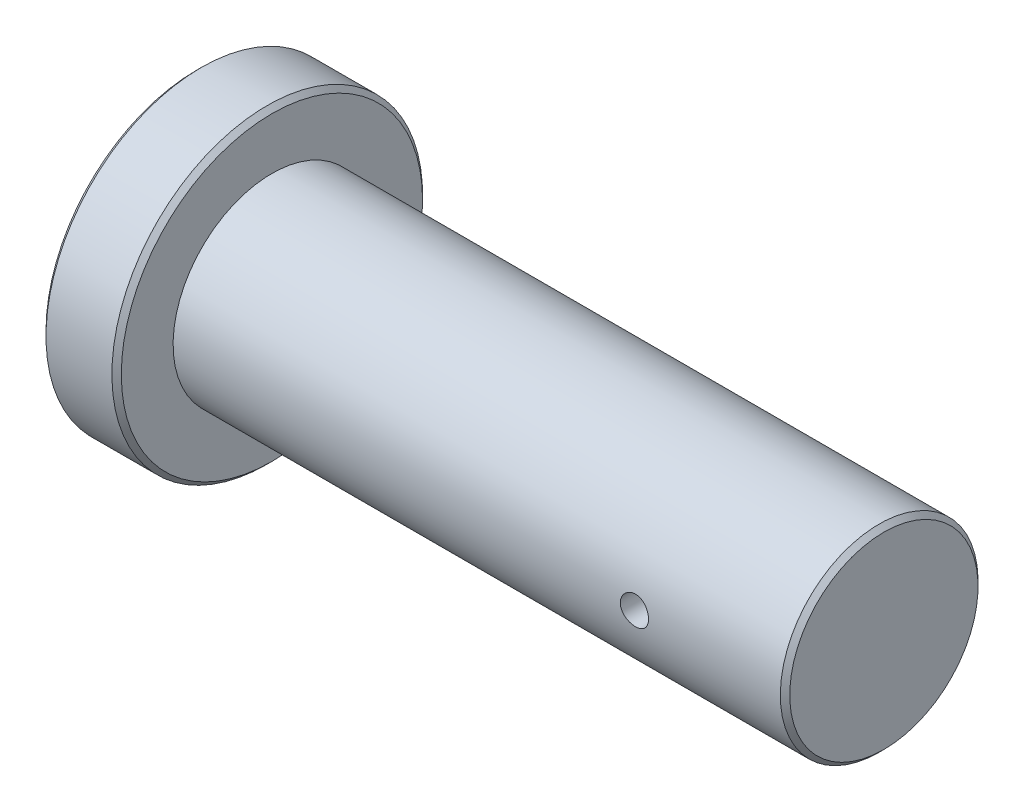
ISO-10303-21;
HEADER;
FILE_DESCRIPTION(('STEP AP214'),'2;1');
FILE_NAME('part.step','',(''),(''),'','','');
FILE_SCHEMA(('AUTOMOTIVE_DESIGN { 1 0 10303 214 1 1 1 1 }'));
ENDSEC;
DATA;
#1=APPLICATION_CONTEXT('core data for automotive mechanical design processes');
#2=APPLICATION_PROTOCOL_DEFINITION('international standard','automotive_design',2000,#1);
#3=PRODUCT_CONTEXT('',#1,'mechanical');
#4=PRODUCT('Part','Part','',(#3));
#5=PRODUCT_RELATED_PRODUCT_CATEGORY('part','',(#4));
#6=PRODUCT_DEFINITION_FORMATION('','',#4);
#7=PRODUCT_DEFINITION_CONTEXT('part definition',#1,'design');
#8=PRODUCT_DEFINITION('design','',#6,#7);
#9=PRODUCT_DEFINITION_SHAPE('','',#8);
#10=(LENGTH_UNIT() NAMED_UNIT(*) SI_UNIT(.MILLI.,.METRE.));
#11=(NAMED_UNIT(*) PLANE_ANGLE_UNIT() SI_UNIT($,.RADIAN.));
#12=(NAMED_UNIT(*) SI_UNIT($,.STERADIAN.) SOLID_ANGLE_UNIT());
#13=UNCERTAINTY_MEASURE_WITH_UNIT(LENGTH_MEASURE(1.E-05),#10,'distance_accuracy_value','');
#14=(GEOMETRIC_REPRESENTATION_CONTEXT(3) GLOBAL_UNCERTAINTY_ASSIGNED_CONTEXT((#13)) GLOBAL_UNIT_ASSIGNED_CONTEXT((#10,
#11,#12)) REPRESENTATION_CONTEXT('',''));
#15=CARTESIAN_POINT('',(0.,0.,0.));
#16=DIRECTION('',(0.,0.,1.));
#17=DIRECTION('',(1.,0.,0.));
#18=AXIS2_PLACEMENT_3D('',#15,#16,#17);
#19=CARTESIAN_POINT('',(17.9318018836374,1.14169845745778E-07,0.));
#20=DIRECTION('',(1.,0.,0.));
#21=DIRECTION('',(0.,1.,0.));
#22=AXIS2_PLACEMENT_3D('',#19,#20,#21);
#23=PLANE('',#22);
#24=CARTESIAN_POINT('',(17.9318018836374,1.14169845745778E-07,0.));
#25=DIRECTION('',(1.,0.,0.));
#26=DIRECTION('',(0.,1.,0.));
#27=AXIS2_PLACEMENT_3D('',#24,#25,#26);
#28=CIRCLE('',#27,7.00000000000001);
#29=CARTESIAN_POINT('',(17.9318018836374,7.00000011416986,0.));
#30=VERTEX_POINT('',#29);
#31=EDGE_CURVE('E11',#30,#30,#28,.F.);
#32=ORIENTED_EDGE('',*,*,#31,.T.);
#33=EDGE_LOOP('',(#32));
#34=FACE_BOUND('',#33,.T.);
#35=ADVANCED_FACE('F46',(#34),#23,.F.);
#36=CARTESIAN_POINT('',(17.9318018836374,1.14169845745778E-07,0.));
#37=DIRECTION('',(-1.,0.,0.));
#38=DIRECTION('',(0.,-1.,0.));
#39=AXIS2_PLACEMENT_3D('',#36,#37,#38);
#40=CYLINDRICAL_SURFACE('',#39,7.21875);
#41=CARTESIAN_POINT('',(21.2130518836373,1.14169846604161E-07,0.));
#42=DIRECTION('',(-1.,0.,0.));
#43=DIRECTION('',(0.,-1.,0.));
#44=AXIS2_PLACEMENT_3D('',#41,#42,#43);
#45=CIRCLE('',#44,7.21875);
#46=CARTESIAN_POINT('',(21.2130518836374,-7.21874988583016,0.));
#47=VERTEX_POINT('',#46);
#48=EDGE_CURVE('E57',#47,#47,#45,.T.);
#49=ORIENTED_EDGE('',*,*,#48,.T.);
#50=EDGE_LOOP('',(#49));
#51=FACE_BOUND('',#50,.T.);
#52=CARTESIAN_POINT('',(18.1505518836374,1.14169845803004E-07,0.));
#53=DIRECTION('',(1.,0.,0.));
#54=DIRECTION('',(0.,1.,0.));
#55=AXIS2_PLACEMENT_3D('',#52,#53,#54);
#56=CIRCLE('',#55,7.21875);
#57=CARTESIAN_POINT('',(18.1505518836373,7.21875011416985,0.));
#58=VERTEX_POINT('',#57);
#59=EDGE_CURVE('E61',#58,#58,#56,.T.);
#60=ORIENTED_EDGE('',*,*,#59,.T.);
#61=EDGE_LOOP('',(#60));
#62=FACE_BOUND('',#61,.T.);
#63=ADVANCED_FACE('F105',(#51,#62),#40,.T.);
#64=CARTESIAN_POINT('',(21.4318018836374,7.21875011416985,0.));
#65=DIRECTION('',(-1.,0.,0.));
#66=DIRECTION('',(0.,-1.,0.));
#67=AXIS2_PLACEMENT_3D('',#64,#65,#66);
#68=PLANE('',#67);
#69=CARTESIAN_POINT('',(21.4318018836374,1.14169846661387E-07,0.));
#70=DIRECTION('',(-1.,0.,0.));
#71=DIRECTION('',(0.,-1.,0.));
#72=AXIS2_PLACEMENT_3D('',#69,#70,#71);
#73=CIRCLE('',#72,6.99999999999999);
#74=CARTESIAN_POINT('',(21.4318018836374,-6.99999988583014,0.));
#75=VERTEX_POINT('',#74);
#76=EDGE_CURVE('E53',#75,#75,#73,.F.);
#77=ORIENTED_EDGE('',*,*,#76,.T.);
#78=EDGE_LOOP('',(#77));
#79=FACE_BOUND('',#78,.T.);
#80=CARTESIAN_POINT('',(21.4318018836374,1.14169846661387E-07,0.));
#81=DIRECTION('',(-1.,0.,0.));
#82=DIRECTION('',(0.,-1.,0.));
#83=AXIS2_PLACEMENT_3D('',#80,#81,#82);
#84=CIRCLE('',#83,4.59375);
#85=CARTESIAN_POINT('',(21.4318018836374,-4.59374988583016,0.));
#86=VERTEX_POINT('',#85);
#87=EDGE_CURVE('E72',#86,#86,#84,.T.);
#88=ORIENTED_EDGE('',*,*,#87,.T.);
#89=EDGE_LOOP('',(#88));
#90=FACE_BOUND('',#89,.T.);
#91=ADVANCED_FACE('F102',(#79,#90),#68,.F.);
#92=CARTESIAN_POINT('',(17.9318018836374,1.14169845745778E-07,0.));
#93=DIRECTION('',(-1.,0.,0.));
#94=DIRECTION('',(0.,-1.,0.));
#95=AXIS2_PLACEMENT_3D('',#92,#93,#94);
#96=CYLINDRICAL_SURFACE('',#95,4.59375);
#97=CARTESIAN_POINT('',(49.6505518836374,1.14169854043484E-07,0.));
#98=DIRECTION('',(-1.,0.,0.));
#99=DIRECTION('',(0.,-1.,0.));
#100=AXIS2_PLACEMENT_3D('',#97,#98,#99);
#101=CIRCLE('',#100,4.59375);
#102=CARTESIAN_POINT('',(49.6505518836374,-4.59374988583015,0.));
#103=VERTEX_POINT('',#102);
#104=EDGE_CURVE('E69',#103,#103,#101,.T.);
#105=ORIENTED_EDGE('',*,*,#104,.T.);
#106=EDGE_LOOP('',(#105));
#107=FACE_BOUND('',#106,.T.);
#108=CARTESIAN_POINT('',(43.5255518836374,1.14169845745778E-07,-4.59375));
#109=CARTESIAN_POINT('',(43.5255503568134,0.0366617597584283,-4.59374943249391));
#110=CARTESIAN_POINT('',(43.522469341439,0.0733451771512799,-4.59330650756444));
#111=CARTESIAN_POINT('',(43.5102290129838,0.145688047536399,-4.59158221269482));
#112=CARTESIAN_POINT('',(43.5010636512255,0.181346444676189,-4.59030000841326));
#113=CARTESIAN_POINT('',(43.4769329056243,0.250581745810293,-4.58704135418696));
#114=CARTESIAN_POINT('',(43.46197176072,0.284160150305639,-4.58506541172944));
#115=CARTESIAN_POINT('',(43.4266841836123,0.34832425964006,-4.58063805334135));
#116=CARTESIAN_POINT('',(43.4063585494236,0.37891040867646,-4.57818670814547));
#117=CARTESIAN_POINT('',(43.3607647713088,0.436444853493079,-4.57306197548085));
#118=CARTESIAN_POINT('',(43.3354660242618,0.463368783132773,-4.57038727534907));
#119=CARTESIAN_POINT('',(43.2807099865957,0.512604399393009,-4.56512765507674));
#120=CARTESIAN_POINT('',(43.2512524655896,0.534915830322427,-4.56254273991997));
#121=CARTESIAN_POINT('',(43.1888529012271,0.574386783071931,-4.55774258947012));
#122=CARTESIAN_POINT('',(43.1558959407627,0.591522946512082,-4.55552904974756));
#123=CARTESIAN_POINT('',(43.0875348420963,0.620007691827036,-4.55174004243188));
#124=CARTESIAN_POINT('',(43.0521308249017,0.63135655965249,-4.55016454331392));
#125=CARTESIAN_POINT('',(42.9801359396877,0.647869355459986,-4.5478428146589));
#126=CARTESIAN_POINT('',(42.9435547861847,0.653074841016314,-4.54709101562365));
#127=CARTESIAN_POINT('',(42.8700310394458,0.657281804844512,-4.54648486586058));
#128=CARTESIAN_POINT('',(42.8330884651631,0.656283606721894,-4.54663046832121));
#129=CARTESIAN_POINT('',(42.7601829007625,0.648145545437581,-4.54779757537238));
#130=CARTESIAN_POINT('',(42.7242146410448,0.641051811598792,-4.54881250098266));
#131=CARTESIAN_POINT('',(42.6539842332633,0.620996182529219,-4.5515936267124));
#132=CARTESIAN_POINT('',(42.6197221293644,0.608034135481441,-4.55335984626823));
#133=CARTESIAN_POINT('',(42.5537353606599,0.576561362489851,-4.55745187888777));
#134=CARTESIAN_POINT('',(42.5220202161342,0.558030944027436,-4.55977967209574));
#135=CARTESIAN_POINT('',(42.4621320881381,0.515961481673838,-4.56473110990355));
#136=CARTESIAN_POINT('',(42.4339593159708,0.492422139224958,-4.56735477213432));
#137=CARTESIAN_POINT('',(42.3816881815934,0.440749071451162,-4.57263145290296));
#138=CARTESIAN_POINT('',(42.3576290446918,0.412575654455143,-4.57528452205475));
#139=CARTESIAN_POINT('',(42.3145747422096,0.35256987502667,-4.58029896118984));
#140=CARTESIAN_POINT('',(42.2955795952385,0.320737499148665,-4.58266033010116));
#141=CARTESIAN_POINT('',(42.2631910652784,0.254284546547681,-4.58682745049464));
#142=CARTESIAN_POINT('',(42.2498005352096,0.219662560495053,-4.58863291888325));
#143=CARTESIAN_POINT('',(42.2290345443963,0.148629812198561,-4.59148239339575));
#144=CARTESIAN_POINT('',(42.2216587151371,0.112219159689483,-4.59252644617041));
#145=CARTESIAN_POINT('',(42.2131832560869,0.0389813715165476,-4.59372931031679));
#146=CARTESIAN_POINT('',(42.2120296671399,0.00216060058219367,-4.59389573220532));
#147=CARTESIAN_POINT('',(42.215888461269,-0.0711488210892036,-4.59334524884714));
#148=CARTESIAN_POINT('',(42.2209006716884,-0.107637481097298,-4.59262836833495));
#149=CARTESIAN_POINT('',(42.2369039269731,-0.179084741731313,-4.59039654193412));
#150=CARTESIAN_POINT('',(42.2478688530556,-0.214049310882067,-4.5888850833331));
#151=CARTESIAN_POINT('',(42.2754388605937,-0.281643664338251,-4.58523310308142));
#152=CARTESIAN_POINT('',(42.2920441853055,-0.314273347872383,-4.58309255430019));
#153=CARTESIAN_POINT('',(42.3305514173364,-0.376510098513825,-4.57840155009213));
#154=CARTESIAN_POINT('',(42.3524877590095,-0.406095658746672,-4.57584846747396));
#155=CARTESIAN_POINT('',(42.400986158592,-0.461184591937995,-4.57062521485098));
#156=CARTESIAN_POINT('',(42.4275484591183,-0.486687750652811,-4.56795503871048));
#157=CARTESIAN_POINT('',(42.4847842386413,-0.533082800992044,-4.56277460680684));
#158=CARTESIAN_POINT('',(42.5154870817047,-0.553938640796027,-4.56026570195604));
#159=CARTESIAN_POINT('',(42.5799918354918,-0.590196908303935,-4.55571529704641));
#160=CARTESIAN_POINT('',(42.613793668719,-0.605599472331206,-4.55367378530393));
#161=CARTESIAN_POINT('',(42.6834267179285,-0.630457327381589,-4.5502989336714));
#162=CARTESIAN_POINT('',(42.7192508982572,-0.63993200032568,-4.54896328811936));
#163=CARTESIAN_POINT('',(42.7920023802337,-0.652727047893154,-4.54714512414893));
#164=CARTESIAN_POINT('',(42.8289296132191,-0.656047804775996,-4.54666255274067));
#165=CARTESIAN_POINT('',(42.9024798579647,-0.656432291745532,-4.54660702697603));
#166=CARTESIAN_POINT('',(42.9391025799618,-0.653552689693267,-4.54702583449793));
#167=CARTESIAN_POINT('',(43.011337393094,-0.64173920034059,-4.54870803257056));
#168=CARTESIAN_POINT('',(43.0469494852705,-0.632805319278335,-4.54997142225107));
#169=CARTESIAN_POINT('',(43.116138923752,-0.609156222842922,-4.55319765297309));
#170=CARTESIAN_POINT('',(43.1497175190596,-0.594444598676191,-4.55516005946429));
#171=CARTESIAN_POINT('',(43.2139389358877,-0.559663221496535,-4.55956379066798));
#172=CARTESIAN_POINT('',(43.2445816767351,-0.539593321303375,-4.56200512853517));
#173=CARTESIAN_POINT('',(43.3023500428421,-0.494457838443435,-4.56711826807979));
#174=CARTESIAN_POINT('',(43.3294426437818,-0.469350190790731,-4.56979189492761));
#175=CARTESIAN_POINT('',(43.3790505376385,-0.414940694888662,-4.5750528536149));
#176=CARTESIAN_POINT('',(43.4015647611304,-0.385637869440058,-4.577640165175));
#177=CARTESIAN_POINT('',(43.4414756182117,-0.323499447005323,-4.58245154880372));
#178=CARTESIAN_POINT('',(43.4588462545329,-0.29064701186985,-4.58467375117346));
#179=CARTESIAN_POINT('',(43.4877977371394,-0.222475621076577,-4.58848607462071));
#180=CARTESIAN_POINT('',(43.4993846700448,-0.18715930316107,-4.59007685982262));
#181=CARTESIAN_POINT('',(43.5137668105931,-0.126397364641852,-4.59207775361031));
#182=CARTESIAN_POINT('',(43.5181795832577,-0.101329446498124,-4.59270167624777));
#183=CARTESIAN_POINT('',(43.5240726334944,-0.0508444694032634,-4.59353799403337));
#184=CARTESIAN_POINT('',(43.5255529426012,-0.0254274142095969,-4.59375039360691));
#185=CARTESIAN_POINT('',(43.5255518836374,1.14169845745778E-07,-4.59375));
#186=B_SPLINE_CURVE_WITH_KNOTS('',3,(#108,#109,#110,#111,#112,#113,#114,#115,#116,#117,#118,
#119,#120,#121,#122,#123,#124,#125,#126,#127,#128,#129,#130,#131,#132,#133,#134,#135,#136,#137,
#138,#139,#140,#141,#142,#143,#144,#145,#146,#147,#148,#149,#150,#151,#152,#153,#154,#155,#156,
#157,#158,#159,#160,#161,#162,#163,#164,#165,#166,#167,#168,#169,#170,#171,#172,#173,#174,#175,
#176,#177,#178,#179,#180,#181,#182,#183,#184,#185),.UNSPECIFIED.,.T.,.F.,(4,2,2,2,2,2,2,2,2,2,2,
2,2,2,2,2,2,2,2,2,2,2,2,2,2,2,2,2,2,2,2,2,2,2,2,2,2,2,4),(0.,0.109892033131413,
0.219893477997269,0.329814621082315,0.43971942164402,0.550323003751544,0.660932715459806,
0.772034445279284,0.883130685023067,0.993471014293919,1.10380558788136,1.21331246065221,
1.32282216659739,1.43272380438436,1.54263199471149,1.65353592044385,1.76444025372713,
1.87540097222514,1.98635489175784,2.09634505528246,2.20633213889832,2.31584048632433,
2.42535355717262,2.53559373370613,2.64583969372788,2.75691322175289,2.86798397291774,
2.97868964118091,3.08938843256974,3.19907979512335,3.30877104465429,3.41839422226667,
3.52802041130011,3.63860321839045,3.74921182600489,3.86037029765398,3.97141154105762,
4.04763051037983,4.12384866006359),.UNSPECIFIED.);
#187=CARTESIAN_POINT('',(43.5255518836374,1.14169845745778E-07,-4.59375));
#188=VERTEX_POINT('',#187);
#189=EDGE_CURVE('E73',#188,#188,#186,.T.);
#190=ORIENTED_EDGE('',*,*,#189,.T.);
#191=EDGE_LOOP('',(#190));
#192=FACE_BOUND('',#191,.T.);
#193=CARTESIAN_POINT('',(43.5255518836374,1.14169845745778E-07,4.59375));
#194=CARTESIAN_POINT('',(43.5255503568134,-0.0366615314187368,4.59374943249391));
#195=CARTESIAN_POINT('',(43.522469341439,-0.0733449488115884,4.59330650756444));
#196=CARTESIAN_POINT('',(43.5102290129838,-0.145687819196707,4.59158221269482));
#197=CARTESIAN_POINT('',(43.5010636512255,-0.181346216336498,4.59030000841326));
#198=CARTESIAN_POINT('',(43.4769329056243,-0.250581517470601,4.58704135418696));
#199=CARTESIAN_POINT('',(43.46197176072,-0.284159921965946,4.58506541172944));
#200=CARTESIAN_POINT('',(43.4266841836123,-0.348324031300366,4.58063805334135));
#201=CARTESIAN_POINT('',(43.4063585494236,-0.378910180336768,4.57818670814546));
#202=CARTESIAN_POINT('',(43.3607647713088,-0.436444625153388,4.57306197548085));
#203=CARTESIAN_POINT('',(43.3354660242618,-0.463368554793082,4.57038727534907));
#204=CARTESIAN_POINT('',(43.2807099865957,-0.512604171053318,4.56512765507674));
#205=CARTESIAN_POINT('',(43.2512524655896,-0.534915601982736,4.56254273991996));
#206=CARTESIAN_POINT('',(43.1888529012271,-0.57438655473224,4.55774258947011));
#207=CARTESIAN_POINT('',(43.1558959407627,-0.591522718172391,4.55552904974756));
#208=CARTESIAN_POINT('',(43.0875348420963,-0.620007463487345,4.55174004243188));
#209=CARTESIAN_POINT('',(43.0521308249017,-0.631356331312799,4.55016454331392));
#210=CARTESIAN_POINT('',(42.9801359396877,-0.647869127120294,4.54784281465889));
#211=CARTESIAN_POINT('',(42.9435547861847,-0.653074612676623,4.54709101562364));
#212=CARTESIAN_POINT('',(42.8700310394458,-0.657281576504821,4.54648486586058));
#213=CARTESIAN_POINT('',(42.8330884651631,-0.656283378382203,4.54663046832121));
#214=CARTESIAN_POINT('',(42.7601829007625,-0.64814531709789,4.54779757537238));
#215=CARTESIAN_POINT('',(42.7242146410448,-0.6410515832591,4.54881250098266));
#216=CARTESIAN_POINT('',(42.6539842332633,-0.620995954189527,4.55159362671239));
#217=CARTESIAN_POINT('',(42.6197221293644,-0.60803390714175,4.55335984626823));
#218=CARTESIAN_POINT('',(42.5537353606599,-0.57656113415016,4.55745187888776));
#219=CARTESIAN_POINT('',(42.5220202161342,-0.558030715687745,4.55977967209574));
#220=CARTESIAN_POINT('',(42.4621320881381,-0.515961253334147,4.56473110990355));
#221=CARTESIAN_POINT('',(42.4339593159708,-0.492421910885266,4.56735477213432));
#222=CARTESIAN_POINT('',(42.3816881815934,-0.440748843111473,4.57263145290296));
#223=CARTESIAN_POINT('',(42.3576290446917,-0.412575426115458,4.57528452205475));
#224=CARTESIAN_POINT('',(42.3145747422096,-0.352569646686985,4.58029896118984));
#225=CARTESIAN_POINT('',(42.2955795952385,-0.320737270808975,4.58266033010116));
#226=CARTESIAN_POINT('',(42.2631910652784,-0.254284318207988,4.58682745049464));
#227=CARTESIAN_POINT('',(42.2498005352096,-0.219662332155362,4.58863291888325));
#228=CARTESIAN_POINT('',(42.2290345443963,-0.148629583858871,4.59148239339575));
#229=CARTESIAN_POINT('',(42.2216587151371,-0.112218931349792,4.59252644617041));
#230=CARTESIAN_POINT('',(42.2131832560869,-0.0389811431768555,4.59372931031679));
#231=CARTESIAN_POINT('',(42.2120296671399,-0.00216037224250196,4.59389573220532));
#232=CARTESIAN_POINT('',(42.215888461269,0.071149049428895,4.59334524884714));
#233=CARTESIAN_POINT('',(42.2209006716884,0.107637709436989,4.59262836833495));
#234=CARTESIAN_POINT('',(42.2369039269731,0.179084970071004,4.59039654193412));
#235=CARTESIAN_POINT('',(42.2478688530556,0.214049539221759,4.58888508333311));
#236=CARTESIAN_POINT('',(42.2754388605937,0.281643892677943,4.58523310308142));
#237=CARTESIAN_POINT('',(42.2920441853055,0.314273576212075,4.58309255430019));
#238=CARTESIAN_POINT('',(42.3305514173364,0.376510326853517,4.57840155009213));
#239=CARTESIAN_POINT('',(42.3524877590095,0.406095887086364,4.57584846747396));
#240=CARTESIAN_POINT('',(42.400986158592,0.461184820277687,4.57062521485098));
#241=CARTESIAN_POINT('',(42.4275484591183,0.486687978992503,4.56795503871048));
#242=CARTESIAN_POINT('',(42.4847842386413,0.533083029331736,4.56277460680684));
#243=CARTESIAN_POINT('',(42.5154870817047,0.553938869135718,4.56026570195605));
#244=CARTESIAN_POINT('',(42.5799918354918,0.590197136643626,4.55571529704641));
#245=CARTESIAN_POINT('',(42.613793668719,0.605599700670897,4.55367378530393));
#246=CARTESIAN_POINT('',(42.6834267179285,0.630457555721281,4.5502989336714));
#247=CARTESIAN_POINT('',(42.7192508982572,0.639932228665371,4.54896328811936));
#248=CARTESIAN_POINT('',(42.7920023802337,0.652727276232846,4.54714512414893));
#249=CARTESIAN_POINT('',(42.8289296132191,0.656048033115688,4.54666255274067));
#250=CARTESIAN_POINT('',(42.9024798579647,0.656432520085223,4.54660702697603));
#251=CARTESIAN_POINT('',(42.9391025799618,0.653552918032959,4.54702583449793));
#252=CARTESIAN_POINT('',(43.011337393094,0.641739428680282,4.54870803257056));
#253=CARTESIAN_POINT('',(43.0469494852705,0.632805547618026,4.54997142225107));
#254=CARTESIAN_POINT('',(43.116138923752,0.609156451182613,4.55319765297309));
#255=CARTESIAN_POINT('',(43.1497175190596,0.594444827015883,4.5551600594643));
#256=CARTESIAN_POINT('',(43.2139389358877,0.559663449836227,4.55956379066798));
#257=CARTESIAN_POINT('',(43.2445816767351,0.539593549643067,4.56200512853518));
#258=CARTESIAN_POINT('',(43.3023500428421,0.494458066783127,4.5671182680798));
#259=CARTESIAN_POINT('',(43.3294426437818,0.469350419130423,4.56979189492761));
#260=CARTESIAN_POINT('',(43.3790505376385,0.414940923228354,4.5750528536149));
#261=CARTESIAN_POINT('',(43.4015647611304,0.38563809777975,4.577640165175));
#262=CARTESIAN_POINT('',(43.4414756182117,0.323499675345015,4.58245154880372));
#263=CARTESIAN_POINT('',(43.4588462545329,0.290647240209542,4.58467375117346));
#264=CARTESIAN_POINT('',(43.4877977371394,0.222475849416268,4.58848607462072));
#265=CARTESIAN_POINT('',(43.4993846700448,0.187159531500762,4.59007685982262));
#266=CARTESIAN_POINT('',(43.5137668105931,0.126397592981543,4.59207775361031));
#267=CARTESIAN_POINT('',(43.5181795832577,0.101329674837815,4.59270167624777));
#268=CARTESIAN_POINT('',(43.5240726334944,0.0508446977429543,4.59353799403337));
#269=CARTESIAN_POINT('',(43.5255529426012,0.0254276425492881,4.59375039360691));
#270=CARTESIAN_POINT('',(43.5255518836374,1.14169845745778E-07,4.59375));
#271=B_SPLINE_CURVE_WITH_KNOTS('',3,(#193,#194,#195,#196,#197,#198,#199,#200,#201,#202,#203,
#204,#205,#206,#207,#208,#209,#210,#211,#212,#213,#214,#215,#216,#217,#218,#219,#220,#221,#222,
#223,#224,#225,#226,#227,#228,#229,#230,#231,#232,#233,#234,#235,#236,#237,#238,#239,#240,#241,
#242,#243,#244,#245,#246,#247,#248,#249,#250,#251,#252,#253,#254,#255,#256,#257,#258,#259,#260,
#261,#262,#263,#264,#265,#266,#267,#268,#269,#270),.UNSPECIFIED.,.T.,.F.,(4,2,2,2,2,2,2,2,2,2,2,
2,2,2,2,2,2,2,2,2,2,2,2,2,2,2,2,2,2,2,2,2,2,2,2,2,2,2,4),(0.,0.109892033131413,
0.219893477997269,0.329814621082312,0.43971942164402,0.550323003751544,0.660932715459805,
0.772034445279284,0.883130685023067,0.993471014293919,1.10380558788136,1.21331246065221,
1.32282216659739,1.43272380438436,1.54263199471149,1.65353592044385,1.76444025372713,
1.87540097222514,1.98635489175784,2.09634505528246,2.20633213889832,2.31584048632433,
2.42535355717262,2.53559373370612,2.64583969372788,2.75691322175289,2.86798397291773,
2.97868964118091,3.08938843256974,3.19907979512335,3.30877104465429,3.41839422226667,
3.52802041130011,3.63860321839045,3.74921182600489,3.86037029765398,3.97141154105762,
4.04763051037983,4.12384866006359),.UNSPECIFIED.);
#272=CARTESIAN_POINT('',(43.5255518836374,1.14169845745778E-07,4.59375));
#273=VERTEX_POINT('',#272);
#274=EDGE_CURVE('E81',#273,#273,#271,.T.);
#275=ORIENTED_EDGE('',*,*,#274,.T.);
#276=EDGE_LOOP('',(#275));
#277=FACE_BOUND('',#276,.T.);
#278=ORIENTED_EDGE('',*,*,#87,.F.);
#279=EDGE_LOOP('',(#278));
#280=FACE_BOUND('',#279,.T.);
#281=ADVANCED_FACE('F86',(#107,#192,#277,#280),#96,.T.);
#282=CARTESIAN_POINT('',(49.8693018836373,4.59375011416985,0.));
#283=DIRECTION('',(-1.,0.,0.));
#284=DIRECTION('',(0.,-1.,0.));
#285=AXIS2_PLACEMENT_3D('',#282,#283,#284);
#286=PLANE('',#285);
#287=CARTESIAN_POINT('',(49.8693018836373,1.1416985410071E-07,0.));
#288=DIRECTION('',(-1.,0.,0.));
#289=DIRECTION('',(0.,-1.,0.));
#290=AXIS2_PLACEMENT_3D('',#287,#288,#289);
#291=CIRCLE('',#290,4.37499999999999);
#292=CARTESIAN_POINT('',(49.8693018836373,-4.37499988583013,0.));
#293=VERTEX_POINT('',#292);
#294=EDGE_CURVE('E66',#293,#293,#291,.F.);
#295=ORIENTED_EDGE('',*,*,#294,.T.);
#296=EDGE_LOOP('',(#295));
#297=FACE_BOUND('',#296,.T.);
#298=ADVANCED_FACE('F94',(#297),#286,.F.);
#299=CARTESIAN_POINT('',(42.8693018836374,1.14169845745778E-07,-8.75));
#300=DIRECTION('',(0.,0.,1.));
#301=DIRECTION('',(1.,0.,0.));
#302=AXIS2_PLACEMENT_3D('',#299,#300,#301);
#303=CYLINDRICAL_SURFACE('',#302,0.656249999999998);
#304=ORIENTED_EDGE('',*,*,#274,.F.);
#305=EDGE_LOOP('',(#304));
#306=FACE_BOUND('',#305,.T.);
#307=ORIENTED_EDGE('',*,*,#189,.F.);
#308=EDGE_LOOP('',(#307));
#309=FACE_BOUND('',#308,.T.);
#310=ADVANCED_FACE('F90',(#306,#309),#303,.F.);
#311=CARTESIAN_POINT('',(49.6505518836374,1.14169854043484E-07,0.));
#312=DIRECTION('',(-1.,0.,0.));
#313=DIRECTION('',(0.,-1.,0.));
#314=AXIS2_PLACEMENT_3D('',#311,#312,#313);
#315=CONICAL_SURFACE('',#314,4.59375,0.785398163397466);
#316=ORIENTED_EDGE('',*,*,#294,.F.);
#317=EDGE_LOOP('',(#316));
#318=FACE_BOUND('',#317,.T.);
#319=ORIENTED_EDGE('',*,*,#104,.F.);
#320=EDGE_LOOP('',(#319));
#321=FACE_BOUND('',#320,.T.);
#322=ADVANCED_FACE('F93',(#318,#321),#315,.T.);
#323=CARTESIAN_POINT('',(21.2130518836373,1.14169846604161E-07,0.));
#324=DIRECTION('',(-1.,0.,0.));
#325=DIRECTION('',(0.,-1.,0.));
#326=AXIS2_PLACEMENT_3D('',#323,#324,#325);
#327=CONICAL_SURFACE('',#326,7.21875,0.785398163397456);
#328=ORIENTED_EDGE('',*,*,#76,.F.);
#329=EDGE_LOOP('',(#328));
#330=FACE_BOUND('',#329,.T.);
#331=ORIENTED_EDGE('',*,*,#48,.F.);
#332=EDGE_LOOP('',(#331));
#333=FACE_BOUND('',#332,.T.);
#334=ADVANCED_FACE('F114',(#330,#333),#327,.T.);
#335=CARTESIAN_POINT('',(17.9318018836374,1.14169845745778E-07,0.));
#336=DIRECTION('',(1.,0.,0.));
#337=DIRECTION('',(0.,1.,0.));
#338=AXIS2_PLACEMENT_3D('',#335,#336,#337);
#339=CONICAL_SURFACE('',#338,7.00000000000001,0.785398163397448);
#340=ORIENTED_EDGE('',*,*,#59,.F.);
#341=EDGE_LOOP('',(#340));
#342=FACE_BOUND('',#341,.T.);
#343=ORIENTED_EDGE('',*,*,#31,.F.);
#344=EDGE_LOOP('',(#343));
#345=FACE_BOUND('',#344,.T.);
#346=ADVANCED_FACE('F48',(#342,#345),#339,.T.);
#347=CLOSED_SHELL('',(#35,#63,#91,#281,#298,#310,#322,#334,#346));
#348=MANIFOLD_SOLID_BREP('B2',#347);
#349=ADVANCED_BREP_SHAPE_REPRESENTATION('',(#18,#348),#14);
#350=SHAPE_DEFINITION_REPRESENTATION(#9,#349);
ENDSEC;
END-ISO-10303-21;
